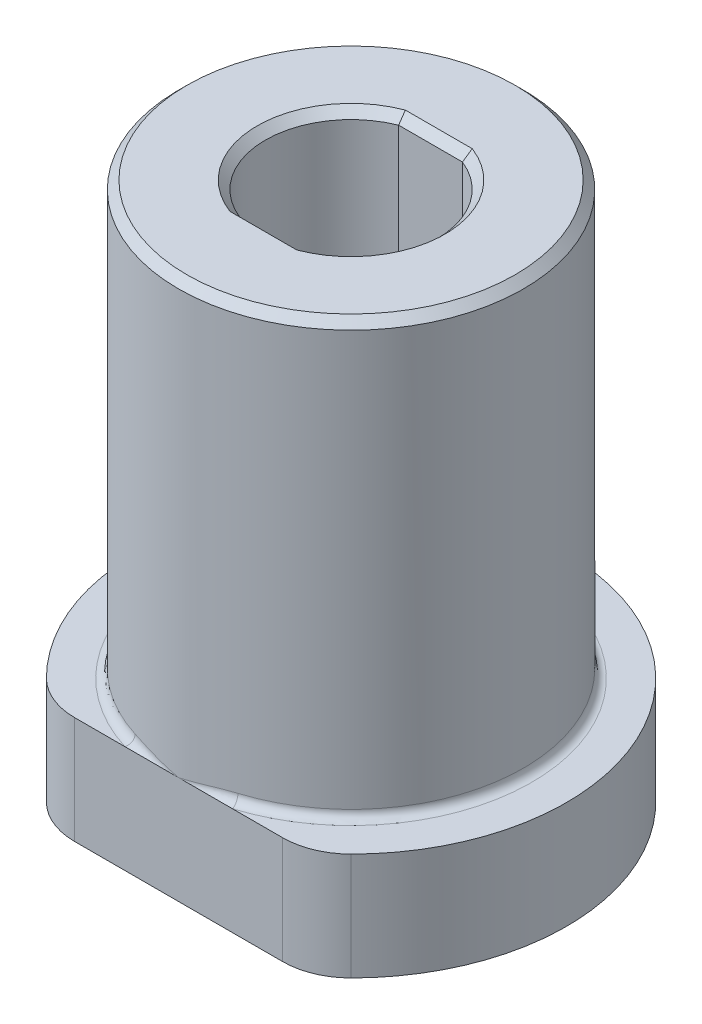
ISO-10303-21;
HEADER;
FILE_DESCRIPTION(('STEP AP214'),'2;1');
FILE_NAME('part.step','',(''),(''),'','','');
FILE_SCHEMA(('AUTOMOTIVE_DESIGN { 1 0 10303 214 1 1 1 1 }'));
ENDSEC;
DATA;
#1=APPLICATION_CONTEXT('core data for automotive mechanical design processes');
#2=APPLICATION_PROTOCOL_DEFINITION('international standard','automotive_design',2000,#1);
#3=PRODUCT_CONTEXT('',#1,'mechanical');
#4=PRODUCT('Part','Part','',(#3));
#5=PRODUCT_RELATED_PRODUCT_CATEGORY('part','',(#4));
#6=PRODUCT_DEFINITION_FORMATION('','',#4);
#7=PRODUCT_DEFINITION_CONTEXT('part definition',#1,'design');
#8=PRODUCT_DEFINITION('design','',#6,#7);
#9=PRODUCT_DEFINITION_SHAPE('','',#8);
#10=(LENGTH_UNIT() NAMED_UNIT(*) SI_UNIT(.MILLI.,.METRE.));
#11=(NAMED_UNIT(*) PLANE_ANGLE_UNIT() SI_UNIT($,.RADIAN.));
#12=(NAMED_UNIT(*) SI_UNIT($,.STERADIAN.) SOLID_ANGLE_UNIT());
#13=UNCERTAINTY_MEASURE_WITH_UNIT(LENGTH_MEASURE(1.E-05),#10,'distance_accuracy_value','');
#14=(GEOMETRIC_REPRESENTATION_CONTEXT(3) GLOBAL_UNCERTAINTY_ASSIGNED_CONTEXT((#13)) GLOBAL_UNIT_ASSIGNED_CONTEXT((#10,
#11,#12)) REPRESENTATION_CONTEXT('',''));
#15=CARTESIAN_POINT('',(0.,0.,0.));
#16=DIRECTION('',(0.,0.,1.));
#17=DIRECTION('',(1.,0.,0.));
#18=AXIS2_PLACEMENT_3D('',#15,#16,#17);
#19=CARTESIAN_POINT('',(0.,24.9936,0.));
#20=DIRECTION('',(0.,-1.,0.));
#21=DIRECTION('',(0.,0.,-1.));
#22=AXIS2_PLACEMENT_3D('',#19,#20,#21);
#23=CYLINDRICAL_SURFACE('',#22,7.99592);
#24=CARTESIAN_POINT('',(0.,24.6126,0.));
#25=DIRECTION('',(0.,1.,0.));
#26=DIRECTION('',(0.,0.,1.));
#27=AXIS2_PLACEMENT_3D('',#24,#25,#26);
#28=CIRCLE('',#27,7.99592);
#29=CARTESIAN_POINT('',(0.,24.6126,7.99592));
#30=VERTEX_POINT('',#29);
#31=EDGE_CURVE('E12',#30,#30,#28,.F.);
#32=ORIENTED_EDGE('',*,*,#31,.T.);
#33=EDGE_LOOP('',(#32));
#34=FACE_BOUND('',#33,.T.);
#35=CARTESIAN_POINT('',(-3.03442522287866,5.26963246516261,7.3977699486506));
#36=CARTESIAN_POINT('',(-2.9681699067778,5.04591455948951,7.42494662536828));
#37=CARTESIAN_POINT('',(-3.01805704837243,4.9454309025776,7.63132576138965));
#38=CARTESIAN_POINT('',(-3.06794418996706,4.84494724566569,7.83770489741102));
#39=CARTESIAN_POINT('',(-3.17901346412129,4.9784,7.99592));
#40=CARTESIAN_POINT('',(-3.01029299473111,5.27835756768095,7.40766961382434));
#41=CARTESIAN_POINT('',(-2.9499497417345,5.05675977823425,7.43217232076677));
#42=CARTESIAN_POINT('',(-2.99888466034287,4.95425714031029,7.63324280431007));
#43=CARTESIAN_POINT('',(-3.04800528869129,4.85167526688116,7.8342887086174));
#44=CARTESIAN_POINT('',(-3.1537313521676,4.9784,7.99592));
#45=CARTESIAN_POINT('',(-2.98587072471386,5.28616459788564,7.41754818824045));
#46=CARTESIAN_POINT('',(-2.93061589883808,5.06697060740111,7.4397746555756));
#47=CARTESIAN_POINT('',(-2.97872883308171,4.96272199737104,7.63573066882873));
#48=CARTESIAN_POINT('',(-3.0270199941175,4.85840598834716,7.83166032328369));
#49=CARTESIAN_POINT('',(-3.12814537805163,4.9784,7.99592));
#50=CARTESIAN_POINT('',(-2.93659881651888,5.30020744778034,7.43719183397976));
#51=CARTESIAN_POINT('',(-2.89039429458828,5.08606391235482,7.4554180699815));
#52=CARTESIAN_POINT('',(-2.93692498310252,4.97887261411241,7.64156416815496));
#53=CARTESIAN_POINT('',(-2.98362846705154,4.87161311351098,7.82768762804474));
#54=CARTESIAN_POINT('',(-3.07652569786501,4.9784,7.99592));
#55=CARTESIAN_POINT('',(-2.91174960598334,5.30644475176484,7.44695700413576));
#56=CARTESIAN_POINT('',(-2.8695058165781,5.09496586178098,7.46346096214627));
#57=CARTESIAN_POINT('',(-2.91527839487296,4.98655910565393,7.64490898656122));
#58=CARTESIAN_POINT('',(-2.96121909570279,4.87809683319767,7.82632993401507));
#59=CARTESIAN_POINT('',(-3.05049243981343,4.9784,7.99592));
#60=CARTESIAN_POINT('',(-2.86181343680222,5.31761001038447,7.46628933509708));
#61=CARTESIAN_POINT('',(-2.82669405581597,5.11150166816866,7.47973713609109));
#62=CARTESIAN_POINT('',(-2.87100335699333,5.0010893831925,7.65216513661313));
#63=CARTESIAN_POINT('',(-2.91547976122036,4.8906225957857,7.82456527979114));
#64=CARTESIAN_POINT('',(-2.99817684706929,4.9784,7.99592));
#65=CARTESIAN_POINT('',(-2.83672754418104,5.32254225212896,7.47585704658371));
#66=CARTESIAN_POINT('',(-2.80476947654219,5.11915401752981,7.48797310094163));
#67=CARTESIAN_POINT('',(-2.84837841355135,5.00793588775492,7.65607454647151));
#68=CARTESIAN_POINT('',(-2.89214641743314,4.8966730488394,7.82414754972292));
#69=CARTESIAN_POINT('',(-2.97189562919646,4.9784,7.99592));
#70=CARTESIAN_POINT('',(-2.7863021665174,5.33130554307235,7.4947970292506));
#71=CARTESIAN_POINT('',(-2.76007575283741,5.13334447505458,7.50453603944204));
#72=CARTESIAN_POINT('',(-2.80232233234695,5.02085226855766,7.66430221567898));
#73=CARTESIAN_POINT('',(-2.84472668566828,4.9083159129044,7.82404023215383));
#74=CARTESIAN_POINT('',(-2.9190675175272,4.9784,7.99592));
#75=CARTESIAN_POINT('',(-2.76096261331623,5.33513628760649,7.50416924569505));
#76=CARTESIAN_POINT('',(-2.73729969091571,5.13989384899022,7.51286703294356));
#77=CARTESIAN_POINT('',(-2.77889097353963,5.02692192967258,7.6686205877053));
#78=CARTESIAN_POINT('',(-2.82063201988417,4.91391457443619,7.82434583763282));
#79=CARTESIAN_POINT('',(-2.89252055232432,4.9784,7.99592));
#80=CARTESIAN_POINT('',(-2.68511018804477,5.34514088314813,7.53178572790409));
#81=CARTESIAN_POINT('',(-2.66863521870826,5.15786392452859,7.53762207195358));
#82=CARTESIAN_POINT('',(-2.70810743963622,5.04392697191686,7.6819080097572));
#83=CARTESIAN_POINT('',(-2.74816348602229,4.92984869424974,7.82608472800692));
#84=CARTESIAN_POINT('',(-2.8130538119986,4.9784,7.99592));
#85=CARTESIAN_POINT('',(-2.63431009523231,5.34992212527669,7.54970548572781));
#86=CARTESIAN_POINT('',(-2.62155004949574,5.16791630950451,7.55413558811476));
#87=CARTESIAN_POINT('',(-2.65985814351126,5.0537881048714,7.69128011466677));
#88=CARTESIAN_POINT('',(-2.69868878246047,4.93956695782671,7.82832293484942));
#89=CARTESIAN_POINT('',(-2.75983313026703,4.9784,7.99592));
#90=CARTESIAN_POINT('',(-2.5321622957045,5.35656697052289,7.58457710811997));
#91=CARTESIAN_POINT('',(-2.52575096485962,5.18476074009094,7.58669242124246));
#92=CARTESIAN_POINT('',(-2.56178706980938,5.07102987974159,7.71046720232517));
#93=CARTESIAN_POINT('',(-2.59834127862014,4.95720899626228,7.83414009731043));
#94=CARTESIAN_POINT('',(-2.65281805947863,4.9784,7.99592));
#95=CARTESIAN_POINT('',(-2.48081403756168,5.35842728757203,7.60152786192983));
#96=CARTESIAN_POINT('',(-2.476981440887,5.1915959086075,7.60276426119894));
#97=CARTESIAN_POINT('',(-2.51196358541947,5.07840772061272,7.72028267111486));
#98=CARTESIAN_POINT('',(-2.54740733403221,4.96516270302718,7.83771075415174));
#99=CARTESIAN_POINT('',(-2.59902309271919,4.9784,7.99592));
#100=CARTESIAN_POINT('',(-2.35695109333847,5.36005826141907,7.64102606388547));
#101=CARTESIAN_POINT('',(-2.35865831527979,5.20475953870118,7.64046190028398));
#102=CARTESIAN_POINT('',(-2.39093121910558,5.0935846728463,7.74393634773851));
#103=CARTESIAN_POINT('',(-2.42410664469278,4.98229517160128,7.84723457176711));
#104=CARTESIAN_POINT('',(-2.46925816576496,4.9784,7.99592));
#105=CARTESIAN_POINT('',(-2.28426201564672,5.3586817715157,7.66306954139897));
#106=CARTESIAN_POINT('',(-2.28824392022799,5.20987514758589,7.66186624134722));
#107=CARTESIAN_POINT('',(-2.31921090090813,5.10035088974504,7.75779847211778));
#108=CARTESIAN_POINT('',(-2.35094762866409,4.99077024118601,7.85358642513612));
#109=CARTESIAN_POINT('',(-2.39310550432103,4.9784,7.99592));
#110=CARTESIAN_POINT('',(-2.13841236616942,5.35234649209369,7.70504348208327));
#111=CARTESIAN_POINT('',(-2.14608877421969,5.2159486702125,7.70289111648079));
#112=CARTESIAN_POINT('',(-2.17444655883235,5.11049731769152,7.7849810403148));
#113=CARTESIAN_POINT('',(-2.20356234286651,5.00499525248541,7.86692837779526));
#114=CARTESIAN_POINT('',(-2.24030622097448,4.9784,7.99592));
#115=CARTESIAN_POINT('',(-2.06525163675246,5.34738643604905,7.72497319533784));
#116=CARTESIAN_POINT('',(-2.07423236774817,5.21695409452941,7.72256691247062));
#117=CARTESIAN_POINT('',(-2.10140207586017,5.11387633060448,7.79830129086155));
#118=CARTESIAN_POINT('',(-2.1292130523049,5.01078563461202,7.87392414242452));
#119=CARTESIAN_POINT('',(-2.16365943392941,4.9784,7.99592));
#120=CARTESIAN_POINT('',(-1.84517723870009,5.32828509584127,7.78158115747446));
#121=CARTESIAN_POINT('',(-1.85820950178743,5.21505965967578,7.77841891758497));
#122=CARTESIAN_POINT('',(-1.88083511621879,5.11991143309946,7.83688185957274));
#123=CARTESIAN_POINT('',(-1.90602930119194,5.02468381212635,7.89489425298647));
#124=CARTESIAN_POINT('',(-1.93309864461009,4.9784,7.99592));
#125=CARTESIAN_POINT('',(-1.69776296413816,5.30992357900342,7.81504906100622));
#126=CARTESIAN_POINT('',(-1.71119566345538,5.20738228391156,7.81214210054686));
#127=CARTESIAN_POINT('',(-1.73196952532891,5.11845614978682,7.86074344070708));
#128=CARTESIAN_POINT('',(-1.75457542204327,5.02958269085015,7.90908570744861));
#129=CARTESIAN_POINT('',(-1.77866018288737,4.9784,7.99592));
#130=CARTESIAN_POINT('',(-1.4011758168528,5.26585322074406,7.87365791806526));
#131=CARTESIAN_POINT('',(-1.41479580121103,5.18351652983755,7.87121807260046));
#132=CARTESIAN_POINT('',(-1.43135854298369,5.10825372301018,7.9033127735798));
#133=CARTESIAN_POINT('',(-1.449735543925,5.03306194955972,7.93515020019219));
#134=CARTESIAN_POINT('',(-1.46794086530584,4.9784,7.99592));
#135=CARTESIAN_POINT('',(-1.25199811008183,5.24008935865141,7.89873335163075));
#136=CARTESIAN_POINT('',(-1.26475245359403,5.16731273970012,7.89674174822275));
#137=CARTESIAN_POINT('',(-1.27959984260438,5.09945099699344,7.92197978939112));
#138=CARTESIAN_POINT('',(-1.29567121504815,5.03167866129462,7.94709243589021));
#139=CARTESIAN_POINT('',(-1.3116549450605,4.9784,7.99592));
#140=CARTESIAN_POINT('',(-0.953224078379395,5.18394429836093,7.94033043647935));
#141=CARTESIAN_POINT('',(-0.964070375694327,5.12957671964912,7.93903448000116));
#142=CARTESIAN_POINT('',(-0.97504638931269,5.07711652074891,7.95325910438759));
#143=CARTESIAN_POINT('',(-0.987233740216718,5.02474550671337,7.96735900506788));
#144=CARTESIAN_POINT('',(-0.99864453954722,4.9784,7.99592));
#145=CARTESIAN_POINT('',(-0.803627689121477,5.15356234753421,7.95685069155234));
#146=CARTESIAN_POINT('',(-0.812893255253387,5.10801779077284,7.9559480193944));
#147=CARTESIAN_POINT('',(-0.82225147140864,5.06358399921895,7.96587041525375));
#148=CARTESIAN_POINT('',(-0.832305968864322,5.01921553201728,7.97574808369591));
#149=CARTESIAN_POINT('',(-0.841919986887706,4.9784,7.99592));
#150=CARTESIAN_POINT('',(-0.547755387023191,5.09946123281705,7.97784772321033));
#151=CARTESIAN_POINT('',(-0.554256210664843,5.06867942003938,7.97741486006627));
#152=CARTESIAN_POINT('',(-0.560649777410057,5.03820738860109,7.98196929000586));
#153=CARTESIAN_POINT('',(-0.567387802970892,5.00777033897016,7.9865038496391));
#154=CARTESIAN_POINT('',(-0.573855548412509,4.9784,7.99592));
#155=CARTESIAN_POINT('',(-0.441521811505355,5.07637108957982,7.98442911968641));
#156=CARTESIAN_POINT('',(-0.446768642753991,5.05161433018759,7.98415671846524));
#157=CARTESIAN_POINT('',(-0.451961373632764,5.02701517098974,7.98704313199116));
#158=CARTESIAN_POINT('',(-0.45732941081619,5.0024347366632,7.98992438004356));
#159=CARTESIAN_POINT('',(-0.462560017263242,4.9784,7.99592));
#160=CARTESIAN_POINT('',(-0.229218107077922,5.02959670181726,7.99333839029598));
#161=CARTESIAN_POINT('',(-0.232032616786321,5.01680450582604,7.99327229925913));
#162=CARTESIAN_POINT('',(-0.234677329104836,5.00398899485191,7.99392028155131));
#163=CARTESIAN_POINT('',(-0.237496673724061,4.99119184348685,7.9945623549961));
#164=CARTESIAN_POINT('',(-0.240140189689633,4.9784,7.99592));
#165=CARTESIAN_POINT('',(-0.123148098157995,5.00591379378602,7.99567508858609));
#166=CARTESIAN_POINT('',(-0.124619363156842,4.99903570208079,7.99566906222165));
#167=CARTESIAN_POINT('',(-0.126081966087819,4.99215642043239,7.99573037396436));
#168=CARTESIAN_POINT('',(-0.127553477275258,4.98527807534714,7.99579145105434));
#169=CARTESIAN_POINT('',(-0.129016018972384,4.9784,7.99592));
#170=CARTESIAN_POINT('',(-0.0113921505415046,4.98094531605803,7.99591391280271));
#171=CARTESIAN_POINT('',(-0.0115278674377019,4.98030898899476,7.99591377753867));
#172=CARTESIAN_POINT('',(-0.0116635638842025,4.97967265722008,7.99591529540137));
#173=CARTESIAN_POINT('',(-0.0117992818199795,4.97903632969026,7.99591682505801));
#174=CARTESIAN_POINT('',(-0.0119349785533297,4.9784,7.99592));
#175=CARTESIAN_POINT('',(-0.00569605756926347,4.97967265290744,7.99591999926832));
#176=CARTESIAN_POINT('',(-0.00576390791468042,4.97935448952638,7.99592001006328));
#177=CARTESIAN_POINT('',(-0.00583176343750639,4.97903632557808,7.99592000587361));
#178=CARTESIAN_POINT('',(-0.00589961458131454,4.97871816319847,7.99592001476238));
#179=CARTESIAN_POINT('',(-0.00596747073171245,4.9784,7.99592));
#180=CARTESIAN_POINT('',(0.,4.9784,7.99592));
#181=CARTESIAN_POINT('',(0.,4.9784,7.99592));
#182=CARTESIAN_POINT('',(0.,4.9784,7.99592));
#183=CARTESIAN_POINT('',(0.,4.9784,7.99592));
#184=CARTESIAN_POINT('',(0.,4.9784,7.99592));
#185=(BOUNDED_SURFACE() B_SPLINE_SURFACE(3,2,((#35,#36,#37,#38,#39),(#40,#41,#42,#43,#44),(#45,
#46,#47,#48,#49),(#50,#51,#52,#53,#54),(#55,#56,#57,#58,#59),(#60,#61,#62,#63,#64),(#65,#66,#67,
#68,#69),(#70,#71,#72,#73,#74),(#75,#76,#77,#78,#79),(#80,#81,#82,#83,#84),(#85,#86,#87,#88,
#89),(#90,#91,#92,#93,#94),(#95,#96,#97,#98,#99),(#100,#101,#102,#103,#104),(#105,#106,#107,
#108,#109),(#110,#111,#112,#113,#114),(#115,#116,#117,#118,#119),(#120,#121,#122,#123,#124),
(#125,#126,#127,#128,#129),(#130,#131,#132,#133,#134),(#135,#136,#137,#138,#139),(#140,#141,
#142,#143,#144),(#145,#146,#147,#148,#149),(#150,#151,#152,#153,#154),(#155,#156,#157,#158,
#159),(#160,#161,#162,#163,#164),(#165,#166,#167,#168,#169),(#170,#171,#172,#173,#174),(#175,
#176,#177,#178,#179),(#180,#181,#182,#183,#184)),.UNSPECIFIED.,.F.,.F.,
.F.) B_SPLINE_SURFACE_WITH_KNOTS((4,2,2,2,2,2,2,2,2,2,2,2,2,2,4),(3,2,3),(0.,0.0860131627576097,
0.171944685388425,0.257590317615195,0.343259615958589,0.51304724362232,0.683025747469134,
0.921641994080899,1.16034261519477,1.63804478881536,2.1193938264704,2.60082139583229,
2.94236710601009,3.28320197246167,3.30150708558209),(0.,0.5,1.),
.UNSPECIFIED.) GEOMETRIC_REPRESENTATION_ITEM() RATIONAL_B_SPLINE_SURFACE(((1.,0.851220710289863,
1.,0.851220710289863,1.),(1.,0.855203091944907,1.,0.855203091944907,1.),(1.,0.858993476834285,
1.,0.858993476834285,1.),(1.,0.866236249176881,1.,0.866236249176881,1.),(1.,0.869688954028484,
1.,0.869688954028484,1.),(1.,0.876298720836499,1.,0.876298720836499,1.),(1.,0.879456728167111,
1.,0.879456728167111,1.),(1.,0.885527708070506,1.,0.885527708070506,1.),(1.,0.888440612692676,
1.,0.888440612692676,1.),(1.,0.896807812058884,1.,0.896807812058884,1.),(1.,0.901949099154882,
1.,0.901949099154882,1.),(1.,0.911570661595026,1.,0.911570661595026,1.),(1.,0.916050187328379,
1.,0.916050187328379,1.),(1.,0.92616226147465,1.,0.92616226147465,1.),(1.,0.931529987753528,1.,
0.931529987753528,1.),(1.,0.941412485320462,1.,0.941412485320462,1.),(1.,0.945926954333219,1.,
0.945926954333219,1.),(1.,0.958423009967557,1.,0.958423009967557,1.),(1.,0.965350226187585,1.,
0.965350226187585,1.),(1.,0.977130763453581,1.,0.977130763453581,1.),(1.,0.981967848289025,1.,
0.981967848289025,1.),(1.,0.989851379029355,1.,0.989851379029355,1.),(1.,0.992897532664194,1.,
0.992897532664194,1.),(1.,0.996737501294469,1.,0.996737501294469,1.),(1.,0.997928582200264,1.,
0.997928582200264,1.),(1.,0.999537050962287,1.,0.999537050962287,1.),(1.,0.999956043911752,1.,
0.999956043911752,1.),(1.,0.999998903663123,1.,0.999998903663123,1.),(1.,0.999999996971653,1.,
0.999999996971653,1.),(1.,1.,1.,1.,1.))) REPRESENTATION_ITEM('') SURFACE());
#186=CARTESIAN_POINT('',(-3.03442522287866,5.26963246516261,7.3977699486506));
#187=CARTESIAN_POINT('',(-3.01029299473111,5.27835756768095,7.40766961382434));
#188=CARTESIAN_POINT('',(-2.98587072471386,5.28616459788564,7.41754818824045));
#189=CARTESIAN_POINT('',(-2.93659881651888,5.30020744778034,7.43719183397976));
#190=CARTESIAN_POINT('',(-2.91174960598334,5.30644475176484,7.44695700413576));
#191=CARTESIAN_POINT('',(-2.86181343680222,5.31761001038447,7.46628933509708));
#192=CARTESIAN_POINT('',(-2.83672754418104,5.32254225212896,7.47585704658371));
#193=CARTESIAN_POINT('',(-2.7863021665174,5.33130554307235,7.4947970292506));
#194=CARTESIAN_POINT('',(-2.76096261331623,5.33513628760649,7.50416924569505));
#195=CARTESIAN_POINT('',(-2.68511018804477,5.34514088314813,7.53178572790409));
#196=CARTESIAN_POINT('',(-2.63431009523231,5.34992212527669,7.54970548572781));
#197=CARTESIAN_POINT('',(-2.5321622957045,5.35656697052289,7.58457710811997));
#198=CARTESIAN_POINT('',(-2.48081403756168,5.35842728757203,7.60152786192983));
#199=CARTESIAN_POINT('',(-2.35695109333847,5.36005826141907,7.64102606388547));
#200=CARTESIAN_POINT('',(-2.28426201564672,5.3586817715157,7.66306954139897));
#201=CARTESIAN_POINT('',(-2.13841236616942,5.35234649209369,7.70504348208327));
#202=CARTESIAN_POINT('',(-2.06525163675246,5.34738643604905,7.72497319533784));
#203=CARTESIAN_POINT('',(-1.84517723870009,5.32828509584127,7.78158115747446));
#204=CARTESIAN_POINT('',(-1.69776296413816,5.30992357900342,7.81504906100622));
#205=CARTESIAN_POINT('',(-1.4011758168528,5.26585322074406,7.87365791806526));
#206=CARTESIAN_POINT('',(-1.25199811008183,5.24008935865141,7.89873335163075));
#207=CARTESIAN_POINT('',(-0.953224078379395,5.18394429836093,7.94033043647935));
#208=CARTESIAN_POINT('',(-0.803627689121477,5.15356234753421,7.95685069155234));
#209=CARTESIAN_POINT('',(-0.547755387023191,5.09946123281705,7.97784772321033));
#210=CARTESIAN_POINT('',(-0.441521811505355,5.07637108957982,7.98442911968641));
#211=CARTESIAN_POINT('',(-0.229218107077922,5.02959670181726,7.99333839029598));
#212=CARTESIAN_POINT('',(-0.123148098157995,5.00591379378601,7.99567508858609));
#213=CARTESIAN_POINT('',(-0.0113921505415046,4.98094531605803,7.99591391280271));
#214=CARTESIAN_POINT('',(-0.00569605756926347,4.97967265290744,7.99591999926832));
#215=CARTESIAN_POINT('',(0.,4.9784,7.99592));
#216=B_SPLINE_CURVE_WITH_KNOTS('',3,(#186,#187,#188,#189,#190,#191,#192,#193,#194,#195,#196,
#197,#198,#199,#200,#201,#202,#203,#204,#205,#206,#207,#208,#209,#210,#211,#212,#213,#214,#215),
.UNSPECIFIED.,.F.,.F.,(4,2,2,2,2,2,2,2,2,2,2,2,2,2,4),(0.,0.0860131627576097,0.171944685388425,
0.257590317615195,0.343259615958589,0.51304724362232,0.683025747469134,0.921641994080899,
1.16034261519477,1.63804478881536,2.1193938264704,2.60082139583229,2.94236710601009,
3.28320197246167,3.30150708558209),.UNSPECIFIED.);
#217=CARTESIAN_POINT('',(-2.38401272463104,5.3594,7.63224868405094));
#218=VERTEX_POINT('',#217);
#219=CARTESIAN_POINT('',(0.,4.9784,7.99592));
#220=VERTEX_POINT('',#219);
#221=EDGE_CURVE('E144',#218,#220,#216,.T.);
#222=ORIENTED_EDGE('',*,*,#221,.T.);
#223=CARTESIAN_POINT('',(3.17901346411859,4.9784,7.99592));
#224=CARTESIAN_POINT('',(3.06794418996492,4.84494724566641,7.83770489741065));
#225=CARTESIAN_POINT('',(3.01805704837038,4.94543090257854,7.63132576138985));
#226=CARTESIAN_POINT('',(2.96816990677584,5.04591455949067,7.42494662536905));
#227=CARTESIAN_POINT('',(3.03442522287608,5.26963246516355,7.39776994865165));
#228=CARTESIAN_POINT('',(3.15373135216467,4.9784,7.99592));
#229=CARTESIAN_POINT('',(3.04800528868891,4.85167526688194,7.83428870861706));
#230=CARTESIAN_POINT('',(2.99888466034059,4.95425714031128,7.63324280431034));
#231=CARTESIAN_POINT('',(2.94994974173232,5.05675977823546,7.43217232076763));
#232=CARTESIAN_POINT('',(3.01029299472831,5.27835756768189,7.40766961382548));
#233=CARTESIAN_POINT('',(3.12814537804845,4.9784,7.99592));
#234=CARTESIAN_POINT('',(3.02701999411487,4.85840598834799,7.83166032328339));
#235=CARTESIAN_POINT('',(2.97872883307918,4.96272199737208,7.63573066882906));
#236=CARTESIAN_POINT('',(2.93061589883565,5.06697060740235,7.43977465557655));
#237=CARTESIAN_POINT('',(2.98587072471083,5.28616459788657,7.41754818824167));
#238=CARTESIAN_POINT('',(3.07652569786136,4.9784,7.99592));
#239=CARTESIAN_POINT('',(2.98362846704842,4.8716131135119,7.82768762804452));
#240=CARTESIAN_POINT('',(2.93692498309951,4.97887261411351,7.64156416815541));
#241=CARTESIAN_POINT('',(2.89039429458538,5.08606391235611,7.45541806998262));
#242=CARTESIAN_POINT('',(2.93659881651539,5.30020744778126,7.43719183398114));
#243=CARTESIAN_POINT('',(3.05049243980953,4.9784,7.99592));
#244=CARTESIAN_POINT('',(2.96121909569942,4.87809683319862,7.82632993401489));
#245=CARTESIAN_POINT('',(2.9152783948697,4.98655910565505,7.64490898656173));
#246=CARTESIAN_POINT('',(2.86950581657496,5.09496586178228,7.46346096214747));
#247=CARTESIAN_POINT('',(2.91174960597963,5.30644475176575,7.44695700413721));
#248=CARTESIAN_POINT('',(2.99817684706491,4.9784,7.99592));
#249=CARTESIAN_POINT('',(2.9154797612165,4.89062259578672,7.82456527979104));
#250=CARTESIAN_POINT('',(2.87100335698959,5.00108938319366,7.65216513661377));
#251=CARTESIAN_POINT('',(2.82669405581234,5.11150166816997,7.47973713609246));
#252=CARTESIAN_POINT('',(2.86181343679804,5.31761001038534,7.46628933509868));
#253=CARTESIAN_POINT('',(2.97189562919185,4.9784,7.99592));
#254=CARTESIAN_POINT('',(2.89214641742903,4.89667304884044,7.82414754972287));
#255=CARTESIAN_POINT('',(2.84837841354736,5.0079358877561,7.65607454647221));
#256=CARTESIAN_POINT('',(2.80476947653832,5.11915401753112,7.48797310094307));
#257=CARTESIAN_POINT('',(2.83672754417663,5.3225422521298,7.47585704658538));
#258=CARTESIAN_POINT('',(2.91906751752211,4.9784,7.99592));
#259=CARTESIAN_POINT('',(2.84472668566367,4.90831591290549,7.82404023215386));
#260=CARTESIAN_POINT('',(2.80232233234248,5.02085226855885,7.66430221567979));
#261=CARTESIAN_POINT('',(2.76007575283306,5.13334447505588,7.50453603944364));
#262=CARTESIAN_POINT('',(2.78630216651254,5.33130554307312,7.4947970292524));
#263=CARTESIAN_POINT('',(2.89252055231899,4.9784,7.99592));
#264=CARTESIAN_POINT('',(2.82063201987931,4.9139145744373,7.8243458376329));
#265=CARTESIAN_POINT('',(2.77889097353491,5.02692192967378,7.66862058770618));
#266=CARTESIAN_POINT('',(2.73729969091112,5.1398938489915,7.51286703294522));
#267=CARTESIAN_POINT('',(2.76096261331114,5.33513628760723,7.50416924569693));
#268=CARTESIAN_POINT('',(2.81305381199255,4.9784,7.99592));
#269=CARTESIAN_POINT('',(2.7481634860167,4.92984869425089,7.82608472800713));
#270=CARTESIAN_POINT('',(2.70810743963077,5.04392697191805,7.68190800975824));
#271=CARTESIAN_POINT('',(2.66863521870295,5.15786392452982,7.53762207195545));
#272=CARTESIAN_POINT('',(2.68511018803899,5.34514088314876,7.53178572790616));
#273=CARTESIAN_POINT('',(2.7598331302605,4.9784,7.99592));
#274=CARTESIAN_POINT('',(2.69868878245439,4.93956695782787,7.82832293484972));
#275=CARTESIAN_POINT('',(2.65985814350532,5.05378810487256,7.69128011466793));
#276=CARTESIAN_POINT('',(2.62155004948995,5.16791630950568,7.55413558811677));
#277=CARTESIAN_POINT('',(2.63431009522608,5.34992212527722,7.54970548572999));
#278=CARTESIAN_POINT('',(2.65281805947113,4.9784,7.99592));
#279=CARTESIAN_POINT('',(2.59834127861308,4.95720899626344,7.83414009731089));
#280=CARTESIAN_POINT('',(2.56178706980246,5.07102987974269,7.71046720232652));
#281=CARTESIAN_POINT('',(2.52575096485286,5.18476074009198,7.58669242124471));
#282=CARTESIAN_POINT('',(2.53216229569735,5.35656697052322,7.58457710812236));
#283=CARTESIAN_POINT('',(2.59902309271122,4.9784,7.99592));
#284=CARTESIAN_POINT('',(2.54740733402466,4.96516270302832,7.83771075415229));
#285=CARTESIAN_POINT('',(2.51196358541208,5.07840772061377,7.72028267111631));
#286=CARTESIAN_POINT('',(2.47698144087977,5.19159590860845,7.6027642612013));
#287=CARTESIAN_POINT('',(2.48081403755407,5.35842728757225,7.60152786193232));
#288=CARTESIAN_POINT('',(2.46925816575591,4.9784,7.99592));
#289=CARTESIAN_POINT('',(2.42410664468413,4.98229517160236,7.84723457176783));
#290=CARTESIAN_POINT('',(2.39093121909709,5.0935846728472,7.74393634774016));
#291=CARTESIAN_POINT('',(2.35865831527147,5.2047595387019,7.64046190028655));
#292=CARTESIAN_POINT('',(2.35695109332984,5.36005826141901,7.64102606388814));
#293=CARTESIAN_POINT('',(2.39310550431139,4.9784,7.99592));
#294=CARTESIAN_POINT('',(2.35094762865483,4.99077024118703,7.85358642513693));
#295=CARTESIAN_POINT('',(2.31921090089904,5.10035088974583,7.75779847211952));
#296=CARTESIAN_POINT('',(2.28824392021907,5.20987514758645,7.66186624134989));
#297=CARTESIAN_POINT('',(2.28426201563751,5.35868177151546,7.66306954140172));
#298=CARTESIAN_POINT('',(2.24030622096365,4.9784,7.99592));
#299=CARTESIAN_POINT('',(2.20356234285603,5.00499525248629,7.86692837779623));
#300=CARTESIAN_POINT('',(2.17444655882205,5.11049731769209,7.7849810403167));
#301=CARTESIAN_POINT('',(2.14608877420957,5.21594867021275,7.70289111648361));
#302=CARTESIAN_POINT('',(2.13841236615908,5.35234649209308,7.70504348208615));
#303=CARTESIAN_POINT('',(2.16365943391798,4.9784,7.99592));
#304=CARTESIAN_POINT('',(2.12921305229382,5.01078563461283,7.87392414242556));
#305=CARTESIAN_POINT('',(2.10140207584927,5.11387633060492,7.79830129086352));
#306=CARTESIAN_POINT('',(2.07423236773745,5.21695409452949,7.7225669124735));
#307=CARTESIAN_POINT('',(2.06525163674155,5.34738643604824,7.72497319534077));
#308=CARTESIAN_POINT('',(1.93309864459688,4.9784,7.99592));
#309=CARTESIAN_POINT('',(1.90602930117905,5.02468381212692,7.89489425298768));
#310=CARTESIAN_POINT('',(1.8808351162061,5.11991143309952,7.83688185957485));
#311=CARTESIAN_POINT('',(1.85820950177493,5.21505965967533,7.77841891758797));
#312=CARTESIAN_POINT('',(1.84517723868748,5.32828509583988,7.78158115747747));
#313=CARTESIAN_POINT('',(1.77866018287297,4.9784,7.99592));
#314=CARTESIAN_POINT('',(1.75457542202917,5.02958269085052,7.90908570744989));
#315=CARTESIAN_POINT('',(1.73196952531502,5.11845614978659,7.86074344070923));
#316=CARTESIAN_POINT('',(1.71119566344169,5.20738228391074,7.81214210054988));
#317=CARTESIAN_POINT('',(1.69776296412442,5.30992357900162,7.81504906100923));
#318=CARTESIAN_POINT('',(1.46794086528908,4.9784,7.99592));
#319=CARTESIAN_POINT('',(1.44973554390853,5.0330619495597,7.93515020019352));
#320=CARTESIAN_POINT('',(1.43135854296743,5.10825372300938,7.90331277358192));
#321=CARTESIAN_POINT('',(1.41479580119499,5.18351652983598,7.87121807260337));
#322=CARTESIAN_POINT('',(1.4011758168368,5.26585322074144,7.87365791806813));
#323=CARTESIAN_POINT('',(1.31165494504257,4.9784,7.99592));
#324=CARTESIAN_POINT('',(1.29567121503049,5.0316786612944,7.94709243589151));
#325=CARTESIAN_POINT('',(1.27959984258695,5.09945099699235,7.92197978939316));
#326=CARTESIAN_POINT('',(1.26475245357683,5.16731273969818,7.89674174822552));
#327=CARTESIAN_POINT('',(1.25199811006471,5.24008935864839,7.89873335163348));
#328=CARTESIAN_POINT('',(0.998644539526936,4.9784,7.99592));
#329=CARTESIAN_POINT('',(0.987233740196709,5.02474550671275,7.96735900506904));
#330=CARTESIAN_POINT('',(0.97504638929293,5.07711652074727,7.95325910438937));
#331=CARTESIAN_POINT('',(0.964070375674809,5.12957671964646,7.93903448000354));
#332=CARTESIAN_POINT('',(0.953224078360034,5.18394429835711,7.94033043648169));
#333=CARTESIAN_POINT('',(0.841919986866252,4.9784,7.99592));
#334=CARTESIAN_POINT('',(0.832305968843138,5.01921553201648,7.97574808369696));
#335=CARTESIAN_POINT('',(0.822251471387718,5.06358399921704,7.96587041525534));
#336=CARTESIAN_POINT('',(0.812893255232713,5.10801779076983,7.95594801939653));
#337=CARTESIAN_POINT('',(0.803627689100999,5.15356234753,7.95685069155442));
#338=CARTESIAN_POINT('',(0.573855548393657,4.9784,7.99592));
#339=CARTESIAN_POINT('',(0.567387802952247,5.00777033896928,7.98650384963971));
#340=CARTESIAN_POINT('',(0.560649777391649,5.03820738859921,7.98196929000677));
#341=CARTESIAN_POINT('',(0.554256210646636,5.06867942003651,7.97741486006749));
#342=CARTESIAN_POINT('',(0.547755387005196,5.09946123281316,7.97784772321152));
#343=CARTESIAN_POINT('',(0.462560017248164,4.9784,7.99592));
#344=CARTESIAN_POINT('',(0.457329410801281,5.00243473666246,7.98992438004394));
#345=CARTESIAN_POINT('',(0.451961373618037,5.02701517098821,7.98704313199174));
#346=CARTESIAN_POINT('',(0.446768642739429,5.05161433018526,7.98415671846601));
#347=CARTESIAN_POINT('',(0.441521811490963,5.07637108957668,7.98442911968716));
#348=CARTESIAN_POINT('',(0.240140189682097,4.9784,7.99592));
#349=CARTESIAN_POINT('',(0.237496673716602,4.99119184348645,7.99456235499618));
#350=CARTESIAN_POINT('',(0.234677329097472,5.00398899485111,7.99392028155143));
#351=CARTESIAN_POINT('',(0.232032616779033,5.01680450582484,7.99327229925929));
#352=CARTESIAN_POINT('',(0.229218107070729,5.02959670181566,7.99333839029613));
#353=CARTESIAN_POINT('',(0.129016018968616,4.9784,7.99592));
#354=CARTESIAN_POINT('',(0.127553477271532,4.98527807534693,7.99579145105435));
#355=CARTESIAN_POINT('',(0.126081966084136,4.99215642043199,7.99573037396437));
#356=CARTESIAN_POINT('',(0.124619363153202,4.99903570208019,7.99566906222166));
#357=CARTESIAN_POINT('',(0.123148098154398,5.00591379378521,7.9956750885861));
#358=CARTESIAN_POINT('',(0.0119349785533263,4.9784,7.99592));
#359=CARTESIAN_POINT('',(0.0117992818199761,4.97903632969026,7.99591682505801));
#360=CARTESIAN_POINT('',(0.0116635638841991,4.97967265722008,7.99591529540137));
#361=CARTESIAN_POINT('',(0.0115278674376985,4.98030898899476,7.99591377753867));
#362=CARTESIAN_POINT('',(0.0113921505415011,4.98094531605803,7.99591391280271));
#363=CARTESIAN_POINT('',(0.00596747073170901,4.9784,7.99592));
#364=CARTESIAN_POINT('',(0.00589961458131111,4.97871816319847,7.99592001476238));
#365=CARTESIAN_POINT('',(0.00583176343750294,4.97903632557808,7.99592000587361));
#366=CARTESIAN_POINT('',(0.00576390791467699,4.97935448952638,7.99592001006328));
#367=CARTESIAN_POINT('',(0.00569605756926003,4.97967265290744,7.99591999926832));
#368=CARTESIAN_POINT('',(0.,4.9784,7.99592));
#369=CARTESIAN_POINT('',(0.,4.9784,7.99592));
#370=CARTESIAN_POINT('',(0.,4.9784,7.99592));
#371=CARTESIAN_POINT('',(0.,4.9784,7.99592));
#372=CARTESIAN_POINT('',(0.,4.9784,7.99592));
#373=(BOUNDED_SURFACE() B_SPLINE_SURFACE(3,2,((#223,#224,#225,#226,#227),(#228,#229,#230,#231,
#232),(#233,#234,#235,#236,#237),(#238,#239,#240,#241,#242),(#243,#244,#245,#246,#247),(#248,
#249,#250,#251,#252),(#253,#254,#255,#256,#257),(#258,#259,#260,#261,#262),(#263,#264,#265,#266,
#267),(#268,#269,#270,#271,#272),(#273,#274,#275,#276,#277),(#278,#279,#280,#281,#282),(#283,
#284,#285,#286,#287),(#288,#289,#290,#291,#292),(#293,#294,#295,#296,#297),(#298,#299,#300,#301,
#302),(#303,#304,#305,#306,#307),(#308,#309,#310,#311,#312),(#313,#314,#315,#316,#317),(#318,
#319,#320,#321,#322),(#323,#324,#325,#326,#327),(#328,#329,#330,#331,#332),(#333,#334,#335,#336,
#337),(#338,#339,#340,#341,#342),(#343,#344,#345,#346,#347),(#348,#349,#350,#351,#352),(#353,
#354,#355,#356,#357),(#358,#359,#360,#361,#362),(#363,#364,#365,#366,#367),(#368,#369,#370,#371,
#372)),.UNSPECIFIED.,.F.,.F.,.F.) B_SPLINE_SURFACE_WITH_KNOTS((4,2,2,2,2,2,2,2,2,2,2,2,2,2,4),
(3,2,3),(0.,0.086013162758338,0.171944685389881,0.257590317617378,0.343259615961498,
0.513047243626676,0.68302574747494,0.921641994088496,1.16034261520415,1.63804478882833,
2.11939382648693,2.60082139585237,2.94236710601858,3.28320197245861,3.30150708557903),(0.,0.5,
1.),.UNSPECIFIED.) GEOMETRIC_REPRESENTATION_ITEM() RATIONAL_B_SPLINE_SURFACE(((1.,
0.851220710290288,1.,0.851220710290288,1.),(1.,0.855203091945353,1.,0.855203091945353,1.),(1.,
0.858993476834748,1.,0.858993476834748,1.),(1.,0.866236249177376,1.,0.866236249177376,1.),(1.,
0.869688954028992,1.,0.869688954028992,1.),(1.,0.876298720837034,1.,0.876298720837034,1.),(1.,
0.879456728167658,1.,0.879456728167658,1.),(1.,0.885527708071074,1.,0.885527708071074,1.),(1.,
0.888440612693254,1.,0.888440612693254,1.),(1.,0.896807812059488,1.,0.896807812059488,1.),(1.,
0.901949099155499,1.,0.901949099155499,1.),(1.,0.911570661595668,1.,0.911570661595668,1.),(1.,
0.91605018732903,1.,0.91605018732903,1.),(1.,0.926162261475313,1.,0.926162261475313,1.),(1.,
0.931529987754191,1.,0.931529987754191,1.),(1.,0.941412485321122,1.,0.941412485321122,1.),(1.,
0.945926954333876,1.,0.945926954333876,1.),(1.,0.958423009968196,1.,0.958423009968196,1.),(1.,
0.965350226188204,1.,0.965350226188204,1.),(1.,0.977130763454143,1.,0.977130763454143,1.),(1.,
0.98196784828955,1.,0.98196784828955,1.),(1.,0.989851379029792,1.,0.989851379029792,1.),(1.,
0.992897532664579,1.,0.992897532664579,1.),(1.,0.996737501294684,1.,0.996737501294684,1.),(1.,
0.997928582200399,1.,0.997928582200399,1.),(1.,0.999537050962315,1.,0.999537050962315,1.),(1.,
0.999956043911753,1.,0.999956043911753,1.),(1.,0.999998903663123,1.,0.999998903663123,1.),(1.,
0.999999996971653,1.,0.999999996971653,1.),(1.,1.,1.,1.,1.))) REPRESENTATION_ITEM('') SURFACE());
#374=CARTESIAN_POINT('',(3.03442522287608,5.26963246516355,7.39776994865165));
#375=CARTESIAN_POINT('',(3.01029299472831,5.27835756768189,7.40766961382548));
#376=CARTESIAN_POINT('',(2.98587072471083,5.28616459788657,7.41754818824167));
#377=CARTESIAN_POINT('',(2.93659881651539,5.30020744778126,7.43719183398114));
#378=CARTESIAN_POINT('',(2.91174960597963,5.30644475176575,7.44695700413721));
#379=CARTESIAN_POINT('',(2.86181343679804,5.31761001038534,7.46628933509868));
#380=CARTESIAN_POINT('',(2.83672754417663,5.3225422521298,7.47585704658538));
#381=CARTESIAN_POINT('',(2.78630216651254,5.33130554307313,7.4947970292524));
#382=CARTESIAN_POINT('',(2.76096261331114,5.33513628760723,7.50416924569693));
#383=CARTESIAN_POINT('',(2.68511018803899,5.34514088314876,7.53178572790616));
#384=CARTESIAN_POINT('',(2.63431009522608,5.34992212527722,7.54970548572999));
#385=CARTESIAN_POINT('',(2.53216229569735,5.35656697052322,7.58457710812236));
#386=CARTESIAN_POINT('',(2.48081403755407,5.35842728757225,7.60152786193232));
#387=CARTESIAN_POINT('',(2.35695109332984,5.36005826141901,7.64102606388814));
#388=CARTESIAN_POINT('',(2.28426201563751,5.35868177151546,7.66306954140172));
#389=CARTESIAN_POINT('',(2.13841236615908,5.35234649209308,7.70504348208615));
#390=CARTESIAN_POINT('',(2.06525163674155,5.34738643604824,7.72497319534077));
#391=CARTESIAN_POINT('',(1.84517723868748,5.32828509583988,7.78158115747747));
#392=CARTESIAN_POINT('',(1.69776296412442,5.30992357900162,7.81504906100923));
#393=CARTESIAN_POINT('',(1.4011758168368,5.26585322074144,7.87365791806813));
#394=CARTESIAN_POINT('',(1.25199811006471,5.24008935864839,7.89873335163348));
#395=CARTESIAN_POINT('',(0.953224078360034,5.18394429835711,7.94033043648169));
#396=CARTESIAN_POINT('',(0.803627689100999,5.15356234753,7.95685069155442));
#397=CARTESIAN_POINT('',(0.547755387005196,5.09946123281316,7.97784772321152));
#398=CARTESIAN_POINT('',(0.441521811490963,5.07637108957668,7.98442911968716));
#399=CARTESIAN_POINT('',(0.229218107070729,5.02959670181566,7.99333839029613));
#400=CARTESIAN_POINT('',(0.123148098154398,5.00591379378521,7.99567508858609));
#401=CARTESIAN_POINT('',(0.0113921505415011,4.98094531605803,7.99591391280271));
#402=CARTESIAN_POINT('',(0.00569605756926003,4.97967265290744,7.99591999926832));
#403=CARTESIAN_POINT('',(0.,4.9784,7.99592));
#404=B_SPLINE_CURVE_WITH_KNOTS('',3,(#374,#375,#376,#377,#378,#379,#380,#381,#382,#383,#384,
#385,#386,#387,#388,#389,#390,#391,#392,#393,#394,#395,#396,#397,#398,#399,#400,#401,#402,#403),
.UNSPECIFIED.,.F.,.F.,(4,2,2,2,2,2,2,2,2,2,2,2,2,2,4),(0.,0.086013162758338,0.171944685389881,
0.257590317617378,0.343259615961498,0.513047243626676,0.68302574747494,0.921641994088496,
1.16034261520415,1.63804478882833,2.11939382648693,2.60082139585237,2.94236710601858,
3.28320197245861,3.30150708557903),.UNSPECIFIED.);
#405=CARTESIAN_POINT('',(2.38401272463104,5.3594,7.63224868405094));
#406=VERTEX_POINT('',#405);
#407=EDGE_CURVE('E147',#220,#406,#404,.F.);
#408=ORIENTED_EDGE('',*,*,#407,.T.);
#409=CARTESIAN_POINT('',(0.,5.3594,0.));
#410=DIRECTION('',(0.,-1.,0.));
#411=DIRECTION('',(0.,0.,-1.));
#412=AXIS2_PLACEMENT_3D('',#409,#410,#411);
#413=CIRCLE('',#412,7.99592);
#414=EDGE_CURVE('E150',#406,#218,#413,.F.);
#415=ORIENTED_EDGE('',*,*,#414,.T.);
#416=EDGE_LOOP('',(#222,#408,#415));
#417=FACE_BOUND('',#416,.T.);
#418=ADVANCED_FACE('F38',(#34,#417),#23,.T.);
#419=CARTESIAN_POINT('',(0.,24.9936,0.));
#420=DIRECTION('',(0.,1.,0.));
#421=DIRECTION('',(0.,0.,1.));
#422=AXIS2_PLACEMENT_3D('',#419,#420,#421);
#423=PLANE('',#422);
#424=CARTESIAN_POINT('',(0.,24.9936,0.));
#425=DIRECTION('',(0.,1.,0.));
#426=DIRECTION('',(0.,0.,1.));
#427=AXIS2_PLACEMENT_3D('',#424,#425,#426);
#428=CIRCLE('',#427,7.61491999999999);
#429=CARTESIAN_POINT('',(0.,24.9936,7.61491999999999));
#430=VERTEX_POINT('',#429);
#431=EDGE_CURVE('E46',#430,#430,#428,.T.);
#432=ORIENTED_EDGE('',*,*,#431,.T.);
#433=EDGE_LOOP('',(#432));
#434=FACE_BOUND('',#433,.T.);
#435=DIRECTION('',(1.,0.,0.));
#436=VECTOR('',#435,1.);
#437=CARTESIAN_POINT('',(1.47990424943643,24.9936,-4.07035));
#438=LINE('',#437,#436);
#439=CARTESIAN_POINT('',(-1.55172745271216,24.9936,-4.07035));
#440=VERTEX_POINT('',#439);
#441=CARTESIAN_POINT('',(1.55172745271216,24.9936,-4.07035));
#442=VERTEX_POINT('',#441);
#443=EDGE_CURVE('E375',#440,#442,#438,.T.);
#444=ORIENTED_EDGE('',*,*,#443,.T.);
#445=CARTESIAN_POINT('',(0.,24.9936,0.));
#446=DIRECTION('',(0.,1.,0.));
#447=DIRECTION('',(0.,0.,1.));
#448=AXIS2_PLACEMENT_3D('',#445,#446,#447);
#449=CIRCLE('',#448,4.3561);
#450=CARTESIAN_POINT('',(1.55172745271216,24.9936,4.07035));
#451=VERTEX_POINT('',#450);
#452=EDGE_CURVE('E368',#442,#451,#449,.F.);
#453=ORIENTED_EDGE('',*,*,#452,.T.);
#454=DIRECTION('',(-1.,0.,0.));
#455=VECTOR('',#454,1.);
#456=CARTESIAN_POINT('',(-1.47990424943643,24.9936,4.07035));
#457=LINE('',#456,#455);
#458=CARTESIAN_POINT('',(-1.55172745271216,24.9936,4.07034999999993));
#459=VERTEX_POINT('',#458);
#460=EDGE_CURVE('E371',#451,#459,#457,.T.);
#461=ORIENTED_EDGE('',*,*,#460,.T.);
#462=CARTESIAN_POINT('',(0.,24.9936,0.));
#463=DIRECTION('',(0.,1.,0.));
#464=DIRECTION('',(0.,0.,1.));
#465=AXIS2_PLACEMENT_3D('',#462,#463,#464);
#466=CIRCLE('',#465,4.3561);
#467=EDGE_CURVE('E373',#459,#440,#466,.F.);
#468=ORIENTED_EDGE('',*,*,#467,.T.);
#469=EDGE_LOOP('',(#444,#453,#461,#468));
#470=FACE_BOUND('',#469,.T.);
#471=ADVANCED_FACE('F334',(#434,#470),#423,.T.);
#472=CARTESIAN_POINT('',(0.,4.9784,0.));
#473=DIRECTION('',(0.,-1.,0.));
#474=DIRECTION('',(0.,0.,-1.));
#475=AXIS2_PLACEMENT_3D('',#472,#473,#474);
#476=PLANE('',#475);
#477=DIRECTION('',(-1.,0.,0.));
#478=VECTOR('',#477,1.);
#479=CARTESIAN_POINT('',(-5.99694,4.9784,7.99592));
#480=LINE('',#479,#478);
#481=CARTESIAN_POINT('',(4.82387462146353,4.9784,7.99592));
#482=VERTEX_POINT('',#481);
#483=CARTESIAN_POINT('',(2.49760926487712,4.9784,7.99592));
#484=VERTEX_POINT('',#483);
#485=EDGE_CURVE('E165',#482,#484,#480,.T.);
#486=ORIENTED_EDGE('',*,*,#485,.F.);
#487=CARTESIAN_POINT('',(4.82387462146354,4.9784,4.82092));
#488=DIRECTION('',(0.,-1.,0.));
#489=DIRECTION('',(0.,0.,-1.));
#490=AXIS2_PLACEMENT_3D('',#487,#488,#489);
#491=CIRCLE('',#490,3.175);
#492=CARTESIAN_POINT('',(7.06962630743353,4.9784,7.06529616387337));
#493=VERTEX_POINT('',#492);
#494=EDGE_CURVE('E382',#482,#493,#491,.F.);
#495=ORIENTED_EDGE('',*,*,#494,.T.);
#496=CARTESIAN_POINT('',(0.,4.9784,0.));
#497=DIRECTION('',(0.,-1.,0.));
#498=DIRECTION('',(0.,0.,-1.));
#499=AXIS2_PLACEMENT_3D('',#496,#497,#498);
#500=CIRCLE('',#499,9.9949);
#501=CARTESIAN_POINT('',(-7.06962630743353,4.9784,7.06529616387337));
#502=VERTEX_POINT('',#501);
#503=EDGE_CURVE('E178',#502,#493,#500,.T.);
#504=ORIENTED_EDGE('',*,*,#503,.F.);
#505=CARTESIAN_POINT('',(-4.82387462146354,4.9784,4.82092));
#506=DIRECTION('',(0.,-1.,0.));
#507=DIRECTION('',(0.,0.,-1.));
#508=AXIS2_PLACEMENT_3D('',#505,#506,#507);
#509=CIRCLE('',#508,3.175);
#510=CARTESIAN_POINT('',(-4.82387462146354,4.9784,7.99592));
#511=VERTEX_POINT('',#510);
#512=EDGE_CURVE('E384',#502,#511,#509,.F.);
#513=ORIENTED_EDGE('',*,*,#512,.T.);
#514=CARTESIAN_POINT('',(-2.49760926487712,4.9784,7.99592));
#515=VERTEX_POINT('',#514);
#516=EDGE_CURVE('E170',#515,#511,#480,.T.);
#517=ORIENTED_EDGE('',*,*,#516,.F.);
#518=CARTESIAN_POINT('',(0.,4.9784,0.));
#519=DIRECTION('',(0.,-1.,0.));
#520=DIRECTION('',(0.,0.,-1.));
#521=AXIS2_PLACEMENT_3D('',#518,#519,#520);
#522=CIRCLE('',#521,8.37692);
#523=EDGE_CURVE('E154',#515,#484,#522,.T.);
#524=ORIENTED_EDGE('',*,*,#523,.T.);
#525=EDGE_LOOP('',(#486,#495,#504,#513,#517,#524));
#526=FACE_BOUND('',#525,.T.);
#527=ADVANCED_FACE('F339',(#526),#476,.F.);
#528=CARTESIAN_POINT('',(-5.99694,4.9784,7.99592));
#529=DIRECTION('',(0.,0.,1.));
#530=DIRECTION('',(1.,0.,0.));
#531=AXIS2_PLACEMENT_3D('',#528,#529,#530);
#532=PLANE('',#531);
#533=DIRECTION('',(-1.,0.,0.));
#534=VECTOR('',#533,1.);
#535=CARTESIAN_POINT('',(-5.99694,0.,7.99592));
#536=LINE('',#535,#534);
#537=CARTESIAN_POINT('',(4.82387462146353,0.,7.99592));
#538=VERTEX_POINT('',#537);
#539=CARTESIAN_POINT('',(-4.82387462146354,0.,7.99592));
#540=VERTEX_POINT('',#539);
#541=EDGE_CURVE('E185',#538,#540,#536,.T.);
#542=ORIENTED_EDGE('',*,*,#541,.F.);
#543=DIRECTION('',(0.,-1.,0.));
#544=VECTOR('',#543,1.);
#545=CARTESIAN_POINT('',(4.82387462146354,4.9784,7.99592));
#546=LINE('',#545,#544);
#547=EDGE_CURVE('E386',#538,#482,#546,.F.);
#548=ORIENTED_EDGE('',*,*,#547,.T.);
#549=ORIENTED_EDGE('',*,*,#485,.T.);
#550=EDGE_CURVE('E159',#484,#220,#480,.T.);
#551=ORIENTED_EDGE('',*,*,#550,.T.);
#552=EDGE_CURVE('E163',#220,#515,#480,.T.);
#553=ORIENTED_EDGE('',*,*,#552,.T.);
#554=ORIENTED_EDGE('',*,*,#516,.T.);
#555=DIRECTION('',(0.,-1.,0.));
#556=VECTOR('',#555,1.);
#557=CARTESIAN_POINT('',(-4.82387462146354,4.9784,7.99592));
#558=LINE('',#557,#556);
#559=EDGE_CURVE('E388',#511,#540,#558,.T.);
#560=ORIENTED_EDGE('',*,*,#559,.T.);
#561=EDGE_LOOP('',(#542,#548,#549,#551,#553,#554,#560));
#562=FACE_BOUND('',#561,.T.);
#563=ADVANCED_FACE('F161',(#562),#532,.T.);
#564=CARTESIAN_POINT('',(0.,4.9784,0.));
#565=DIRECTION('',(0.,-1.,0.));
#566=DIRECTION('',(0.,0.,-1.));
#567=AXIS2_PLACEMENT_3D('',#564,#565,#566);
#568=CYLINDRICAL_SURFACE('',#567,9.9949);
#569=ORIENTED_EDGE('',*,*,#503,.T.);
#570=DIRECTION('',(0.,-1.,0.));
#571=VECTOR('',#570,1.);
#572=CARTESIAN_POINT('',(7.06962630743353,4.9784,7.06529616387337));
#573=LINE('',#572,#571);
#574=CARTESIAN_POINT('',(7.06962630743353,0.,7.06529616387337));
#575=VERTEX_POINT('',#574);
#576=EDGE_CURVE('E394',#493,#575,#573,.T.);
#577=ORIENTED_EDGE('',*,*,#576,.T.);
#578=CARTESIAN_POINT('',(0.,0.,0.));
#579=DIRECTION('',(0.,-1.,0.));
#580=DIRECTION('',(0.,0.,-1.));
#581=AXIS2_PLACEMENT_3D('',#578,#579,#580);
#582=CIRCLE('',#581,9.9949);
#583=CARTESIAN_POINT('',(-7.06962630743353,0.,7.06529616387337));
#584=VERTEX_POINT('',#583);
#585=EDGE_CURVE('E404',#584,#575,#582,.T.);
#586=ORIENTED_EDGE('',*,*,#585,.F.);
#587=DIRECTION('',(0.,-1.,0.));
#588=VECTOR('',#587,1.);
#589=CARTESIAN_POINT('',(-7.06962630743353,4.9784,7.06529616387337));
#590=LINE('',#589,#588);
#591=EDGE_CURVE('E173',#584,#502,#590,.F.);
#592=ORIENTED_EDGE('',*,*,#591,.T.);
#593=EDGE_LOOP('',(#569,#577,#586,#592));
#594=FACE_BOUND('',#593,.T.);
#595=ADVANCED_FACE('F403',(#594),#568,.T.);
#596=CARTESIAN_POINT('',(0.,0.,0.));
#597=DIRECTION('',(0.,1.,0.));
#598=DIRECTION('',(0.,0.,1.));
#599=AXIS2_PLACEMENT_3D('',#596,#597,#598);
#600=PLANE('',#599);
#601=CARTESIAN_POINT('',(0.,0.,0.));
#602=DIRECTION('',(0.,1.,0.));
#603=DIRECTION('',(0.,0.,1.));
#604=AXIS2_PLACEMENT_3D('',#601,#602,#603);
#605=CIRCLE('',#604,4.3561);
#606=CARTESIAN_POINT('',(-1.55172745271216,0.,-4.07035));
#607=VERTEX_POINT('',#606);
#608=CARTESIAN_POINT('',(-1.55172745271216,0.,4.07034999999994));
#609=VERTEX_POINT('',#608);
#610=EDGE_CURVE('E61',#607,#609,#605,.T.);
#611=ORIENTED_EDGE('',*,*,#610,.T.);
#612=DIRECTION('',(1.,0.,0.));
#613=VECTOR('',#612,1.);
#614=CARTESIAN_POINT('',(0.,0.,4.07035));
#615=LINE('',#614,#613);
#616=CARTESIAN_POINT('',(1.55172745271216,0.,4.07034999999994));
#617=VERTEX_POINT('',#616);
#618=EDGE_CURVE('E348',#609,#617,#615,.T.);
#619=ORIENTED_EDGE('',*,*,#618,.T.);
#620=CARTESIAN_POINT('',(0.,0.,0.));
#621=DIRECTION('',(0.,1.,0.));
#622=DIRECTION('',(0.,0.,1.));
#623=AXIS2_PLACEMENT_3D('',#620,#621,#622);
#624=CIRCLE('',#623,4.3561);
#625=CARTESIAN_POINT('',(1.55172745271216,0.,-4.07035));
#626=VERTEX_POINT('',#625);
#627=EDGE_CURVE('E349',#617,#626,#624,.T.);
#628=ORIENTED_EDGE('',*,*,#627,.T.);
#629=DIRECTION('',(-1.,0.,0.));
#630=VECTOR('',#629,1.);
#631=CARTESIAN_POINT('',(0.,0.,-4.07035));
#632=LINE('',#631,#630);
#633=EDGE_CURVE('E353',#626,#607,#632,.T.);
#634=ORIENTED_EDGE('',*,*,#633,.T.);
#635=EDGE_LOOP('',(#611,#619,#628,#634));
#636=FACE_BOUND('',#635,.T.);
#637=ORIENTED_EDGE('',*,*,#585,.T.);
#638=CARTESIAN_POINT('',(4.82387462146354,0.,4.82092));
#639=DIRECTION('',(0.,1.,0.));
#640=DIRECTION('',(0.,0.,1.));
#641=AXIS2_PLACEMENT_3D('',#638,#639,#640);
#642=CIRCLE('',#641,3.175);
#643=EDGE_CURVE('E391',#575,#538,#642,.F.);
#644=ORIENTED_EDGE('',*,*,#643,.T.);
#645=ORIENTED_EDGE('',*,*,#541,.T.);
#646=CARTESIAN_POINT('',(-4.82387462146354,0.,4.82092));
#647=DIRECTION('',(0.,1.,0.));
#648=DIRECTION('',(0.,0.,1.));
#649=AXIS2_PLACEMENT_3D('',#646,#647,#648);
#650=CIRCLE('',#649,3.175);
#651=EDGE_CURVE('E393',#540,#584,#650,.F.);
#652=ORIENTED_EDGE('',*,*,#651,.T.);
#653=EDGE_LOOP('',(#637,#644,#645,#652));
#654=FACE_BOUND('',#653,.T.);
#655=ADVANCED_FACE('F229',(#636,#654),#600,.F.);
#656=ORIENTED_EDGE('',*,*,#407,.F.);
#657=ORIENTED_EDGE('',*,*,#550,.F.);
#658=CARTESIAN_POINT('',(2.49760926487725,5.3594,7.99591999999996));
#659=DIRECTION('',(0.954517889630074,0.,-0.298153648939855));
#660=DIRECTION('',(-0.298153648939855,0.,-0.954517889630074));
#661=AXIS2_PLACEMENT_3D('',#658,#659,#660);
#662=CIRCLE('',#661,0.381);
#663=EDGE_CURVE('E172',#406,#484,#662,.F.);
#664=ORIENTED_EDGE('',*,*,#663,.F.);
#665=EDGE_LOOP('',(#656,#657,#664));
#666=FACE_BOUND('',#665,.T.);
#667=ADVANCED_FACE('F171',(#666),#373,.F.);
#668=CARTESIAN_POINT('',(0.,5.3594,0.));
#669=DIRECTION('',(0.,-1.,0.));
#670=DIRECTION('',(0.,0.,-1.));
#671=AXIS2_PLACEMENT_3D('',#668,#669,#670);
#672=TOROIDAL_SURFACE('',#671,8.37692,0.381);
#673=ORIENTED_EDGE('',*,*,#663,.T.);
#674=ORIENTED_EDGE('',*,*,#523,.F.);
#675=CARTESIAN_POINT('',(-2.49760926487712,5.3594,7.99592));
#676=DIRECTION('',(-0.954517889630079,0.,-0.29815364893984));
#677=DIRECTION('',(-0.29815364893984,0.,0.954517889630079));
#678=AXIS2_PLACEMENT_3D('',#675,#676,#677);
#679=CIRCLE('',#678,0.381);
#680=EDGE_CURVE('E176',#218,#515,#679,.T.);
#681=ORIENTED_EDGE('',*,*,#680,.F.);
#682=ORIENTED_EDGE('',*,*,#414,.F.);
#683=EDGE_LOOP('',(#673,#674,#681,#682));
#684=FACE_BOUND('',#683,.T.);
#685=ADVANCED_FACE('F203',(#684),#672,.F.);
#686=ORIENTED_EDGE('',*,*,#552,.F.);
#687=ORIENTED_EDGE('',*,*,#221,.F.);
#688=ORIENTED_EDGE('',*,*,#680,.T.);
#689=EDGE_LOOP('',(#686,#687,#688));
#690=FACE_BOUND('',#689,.T.);
#691=ADVANCED_FACE('F175',(#690),#185,.F.);
#692=CARTESIAN_POINT('',(4.82387462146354,4.9784,4.82092));
#693=DIRECTION('',(0.,-1.,0.));
#694=DIRECTION('',(0.,0.,-1.));
#695=AXIS2_PLACEMENT_3D('',#692,#693,#694);
#696=CYLINDRICAL_SURFACE('',#695,3.175);
#697=ORIENTED_EDGE('',*,*,#494,.F.);
#698=ORIENTED_EDGE('',*,*,#547,.F.);
#699=ORIENTED_EDGE('',*,*,#643,.F.);
#700=ORIENTED_EDGE('',*,*,#576,.F.);
#701=EDGE_LOOP('',(#697,#698,#699,#700));
#702=FACE_BOUND('',#701,.T.);
#703=ADVANCED_FACE('F202',(#702),#696,.T.);
#704=CARTESIAN_POINT('',(-4.82387462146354,4.9784,4.82092));
#705=DIRECTION('',(0.,-1.,0.));
#706=DIRECTION('',(0.,0.,-1.));
#707=AXIS2_PLACEMENT_3D('',#704,#705,#706);
#708=CYLINDRICAL_SURFACE('',#707,3.175);
#709=ORIENTED_EDGE('',*,*,#512,.F.);
#710=ORIENTED_EDGE('',*,*,#591,.F.);
#711=ORIENTED_EDGE('',*,*,#651,.F.);
#712=ORIENTED_EDGE('',*,*,#559,.F.);
#713=EDGE_LOOP('',(#709,#710,#711,#712));
#714=FACE_BOUND('',#713,.T.);
#715=ADVANCED_FACE('F245',(#714),#708,.T.);
#716=CARTESIAN_POINT('',(0.,0.,0.));
#717=DIRECTION('',(0.,1.,0.));
#718=DIRECTION('',(0.,0.,1.));
#719=AXIS2_PLACEMENT_3D('',#716,#717,#718);
#720=CYLINDRICAL_SURFACE('',#719,3.9751);
#721=DIRECTION('',(0.,1.,0.));
#722=VECTOR('',#721,1.);
#723=CARTESIAN_POINT('',(-1.47990424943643,0.,-3.68935));
#724=LINE('',#723,#722);
#725=CARTESIAN_POINT('',(-1.47990424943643,0.381000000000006,-3.68935));
#726=VERTEX_POINT('',#725);
#727=CARTESIAN_POINT('',(-1.47990424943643,24.6126,-3.68935));
#728=VERTEX_POINT('',#727);
#729=EDGE_CURVE('E411',#726,#728,#724,.T.);
#730=ORIENTED_EDGE('',*,*,#729,.T.);
#731=CARTESIAN_POINT('',(0.,24.6126,0.));
#732=DIRECTION('',(0.,1.,0.));
#733=DIRECTION('',(0.,0.,1.));
#734=AXIS2_PLACEMENT_3D('',#731,#732,#733);
#735=CIRCLE('',#734,3.9751);
#736=CARTESIAN_POINT('',(-1.47990424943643,24.6126,3.68935));
#737=VERTEX_POINT('',#736);
#738=EDGE_CURVE('E359',#728,#737,#735,.T.);
#739=ORIENTED_EDGE('',*,*,#738,.T.);
#740=DIRECTION('',(0.,1.,0.));
#741=VECTOR('',#740,1.);
#742=CARTESIAN_POINT('',(-1.47990424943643,0.,3.68935));
#743=LINE('',#742,#741);
#744=CARTESIAN_POINT('',(-1.47990424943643,0.381000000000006,3.68935));
#745=VERTEX_POINT('',#744);
#746=EDGE_CURVE('E293',#745,#737,#743,.T.);
#747=ORIENTED_EDGE('',*,*,#746,.F.);
#748=CARTESIAN_POINT('',(0.,0.381000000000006,0.));
#749=DIRECTION('',(0.,1.,0.));
#750=DIRECTION('',(0.,0.,1.));
#751=AXIS2_PLACEMENT_3D('',#748,#749,#750);
#752=CIRCLE('',#751,3.9751);
#753=EDGE_CURVE('E361',#745,#726,#752,.F.);
#754=ORIENTED_EDGE('',*,*,#753,.T.);
#755=EDGE_LOOP('',(#730,#739,#747,#754));
#756=FACE_BOUND('',#755,.T.);
#757=ADVANCED_FACE('F249',(#756),#720,.F.);
#758=CARTESIAN_POINT('',(-1.47990424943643,0.,-3.68935));
#759=DIRECTION('',(0.,0.,-1.));
#760=DIRECTION('',(-1.,0.,0.));
#761=AXIS2_PLACEMENT_3D('',#758,#759,#760);
#762=PLANE('',#761);
#763=DIRECTION('',(0.,1.,0.));
#764=VECTOR('',#763,1.);
#765=CARTESIAN_POINT('',(1.47990424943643,0.,-3.68935));
#766=LINE('',#765,#764);
#767=CARTESIAN_POINT('',(1.47990424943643,0.381000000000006,-3.68935));
#768=VERTEX_POINT('',#767);
#769=CARTESIAN_POINT('',(1.47990424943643,24.6126,-3.68935));
#770=VERTEX_POINT('',#769);
#771=EDGE_CURVE('E413',#768,#770,#766,.T.);
#772=ORIENTED_EDGE('',*,*,#771,.T.);
#773=DIRECTION('',(-1.,0.,0.));
#774=VECTOR('',#773,1.);
#775=CARTESIAN_POINT('',(-1.47990424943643,24.6126,-3.68935));
#776=LINE('',#775,#774);
#777=EDGE_CURVE('E355',#770,#728,#776,.T.);
#778=ORIENTED_EDGE('',*,*,#777,.T.);
#779=ORIENTED_EDGE('',*,*,#729,.F.);
#780=DIRECTION('',(1.,0.,0.));
#781=VECTOR('',#780,1.);
#782=CARTESIAN_POINT('',(-1.47990424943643,0.381000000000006,-3.68935));
#783=LINE('',#782,#781);
#784=EDGE_CURVE('E357',#726,#768,#783,.T.);
#785=ORIENTED_EDGE('',*,*,#784,.T.);
#786=EDGE_LOOP('',(#772,#778,#779,#785));
#787=FACE_BOUND('',#786,.T.);
#788=ADVANCED_FACE('F448',(#787),#762,.F.);
#789=CARTESIAN_POINT('',(0.,0.,0.));
#790=DIRECTION('',(0.,1.,0.));
#791=DIRECTION('',(0.,0.,1.));
#792=AXIS2_PLACEMENT_3D('',#789,#790,#791);
#793=CYLINDRICAL_SURFACE('',#792,3.9751);
#794=DIRECTION('',(0.,1.,0.));
#795=VECTOR('',#794,1.);
#796=CARTESIAN_POINT('',(1.47990424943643,0.,3.68935));
#797=LINE('',#796,#795);
#798=CARTESIAN_POINT('',(1.47990424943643,0.381000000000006,3.68935));
#799=VERTEX_POINT('',#798);
#800=CARTESIAN_POINT('',(1.47990424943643,24.6126,3.68935));
#801=VERTEX_POINT('',#800);
#802=EDGE_CURVE('E422',#799,#801,#797,.T.);
#803=ORIENTED_EDGE('',*,*,#802,.T.);
#804=CARTESIAN_POINT('',(0.,24.6126,0.));
#805=DIRECTION('',(0.,1.,0.));
#806=DIRECTION('',(0.,0.,1.));
#807=AXIS2_PLACEMENT_3D('',#804,#805,#806);
#808=CIRCLE('',#807,3.9751);
#809=EDGE_CURVE('E377',#801,#770,#808,.T.);
#810=ORIENTED_EDGE('',*,*,#809,.T.);
#811=ORIENTED_EDGE('',*,*,#771,.F.);
#812=CARTESIAN_POINT('',(0.,0.381000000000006,0.));
#813=DIRECTION('',(0.,1.,0.));
#814=DIRECTION('',(0.,0.,1.));
#815=AXIS2_PLACEMENT_3D('',#812,#813,#814);
#816=CIRCLE('',#815,3.9751);
#817=EDGE_CURVE('E380',#768,#799,#816,.F.);
#818=ORIENTED_EDGE('',*,*,#817,.T.);
#819=EDGE_LOOP('',(#803,#810,#811,#818));
#820=FACE_BOUND('',#819,.T.);
#821=ADVANCED_FACE('F446',(#820),#793,.F.);
#822=CARTESIAN_POINT('',(-1.47990424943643,0.,3.68935));
#823=DIRECTION('',(0.,0.,1.));
#824=DIRECTION('',(1.,0.,0.));
#825=AXIS2_PLACEMENT_3D('',#822,#823,#824);
#826=PLANE('',#825);
#827=ORIENTED_EDGE('',*,*,#746,.T.);
#828=DIRECTION('',(1.,0.,0.));
#829=VECTOR('',#828,1.);
#830=CARTESIAN_POINT('',(1.47990424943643,24.6126,3.68935));
#831=LINE('',#830,#829);
#832=EDGE_CURVE('E363',#737,#801,#831,.T.);
#833=ORIENTED_EDGE('',*,*,#832,.T.);
#834=ORIENTED_EDGE('',*,*,#802,.F.);
#835=DIRECTION('',(-1.,0.,0.));
#836=VECTOR('',#835,1.);
#837=CARTESIAN_POINT('',(-1.47990424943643,0.381000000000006,3.68935));
#838=LINE('',#837,#836);
#839=EDGE_CURVE('E365',#799,#745,#838,.T.);
#840=ORIENTED_EDGE('',*,*,#839,.T.);
#841=EDGE_LOOP('',(#827,#833,#834,#840));
#842=FACE_BOUND('',#841,.T.);
#843=ADVANCED_FACE('F431',(#842),#826,.F.);
#844=CARTESIAN_POINT('',(0.,24.6126,0.));
#845=DIRECTION('',(0.,1.,0.));
#846=DIRECTION('',(0.,0.,1.));
#847=AXIS2_PLACEMENT_3D('',#844,#845,#846);
#848=CONICAL_SURFACE('',#847,3.9751,0.785398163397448);
#849=CARTESIAN_POINT('',(-1.55172745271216,24.9936,-4.07034999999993));
#850=CARTESIAN_POINT('',(-1.54003552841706,24.9300737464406,-4.00682374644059));
#851=CARTESIAN_POINT('',(-1.52820430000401,24.8665606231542,-3.94331062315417));
#852=CARTESIAN_POINT('',(-1.50426323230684,24.7395606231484,-3.81631062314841));
#853=CARTESIAN_POINT('',(-1.49215339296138,24.6760737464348,-3.75282374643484));
#854=CARTESIAN_POINT('',(-1.47990424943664,24.6126,-3.68934999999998));
#855=B_SPLINE_CURVE_WITH_KNOTS('',3,(#849,#850,#851,#852,#853,#854),.UNSPECIFIED.,.F.,.F.,(4,2,
4),(0.,0.271790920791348,0.543581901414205),.UNSPECIFIED.);
#856=EDGE_CURVE('E273',#440,#728,#855,.T.);
#857=ORIENTED_EDGE('',*,*,#856,.F.);
#858=ORIENTED_EDGE('',*,*,#467,.F.);
#859=CARTESIAN_POINT('',(-1.55172745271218,24.9936,4.07035));
#860=CARTESIAN_POINT('',(-1.54003552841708,24.9300737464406,4.00682374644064));
#861=CARTESIAN_POINT('',(-1.52820430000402,24.8665606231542,3.9433106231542));
#862=CARTESIAN_POINT('',(-1.50426323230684,24.7395606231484,3.81631062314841));
#863=CARTESIAN_POINT('',(-1.49215339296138,24.6760737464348,3.75282374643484));
#864=CARTESIAN_POINT('',(-1.47990424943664,24.6126,3.68934999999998));
#865=B_SPLINE_CURVE_WITH_KNOTS('',3,(#859,#860,#861,#862,#863,#864),.UNSPECIFIED.,.F.,.F.,(4,2,
4),(0.,0.271790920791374,0.543581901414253),.UNSPECIFIED.);
#866=EDGE_CURVE('E287',#737,#459,#865,.F.);
#867=ORIENTED_EDGE('',*,*,#866,.F.);
#868=ORIENTED_EDGE('',*,*,#738,.F.);
#869=EDGE_LOOP('',(#857,#858,#867,#868));
#870=FACE_BOUND('',#869,.T.);
#871=ADVANCED_FACE('F282',(#870),#848,.F.);
#872=CARTESIAN_POINT('',(-1.47990424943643,24.6126,3.68935));
#873=DIRECTION('',(0.,0.707106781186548,-0.707106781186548));
#874=DIRECTION('',(0.,0.707106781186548,0.707106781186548));
#875=AXIS2_PLACEMENT_3D('',#872,#873,#874);
#876=PLANE('',#875);
#877=ORIENTED_EDGE('',*,*,#866,.T.);
#878=ORIENTED_EDGE('',*,*,#460,.F.);
#879=CARTESIAN_POINT('',(1.55172745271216,24.9936,4.07034999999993));
#880=CARTESIAN_POINT('',(1.54003552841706,24.9300737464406,4.00682374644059));
#881=CARTESIAN_POINT('',(1.52820430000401,24.8665606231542,3.94331062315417));
#882=CARTESIAN_POINT('',(1.50426323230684,24.7395606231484,3.81631062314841));
#883=CARTESIAN_POINT('',(1.49215339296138,24.6760737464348,3.75282374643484));
#884=CARTESIAN_POINT('',(1.47990424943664,24.6126,3.68934999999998));
#885=B_SPLINE_CURVE_WITH_KNOTS('',3,(#879,#880,#881,#882,#883,#884),.UNSPECIFIED.,.F.,.F.,(4,2,
4),(0.,0.271790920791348,0.543581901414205),.UNSPECIFIED.);
#886=EDGE_CURVE('E268',#801,#451,#885,.F.);
#887=ORIENTED_EDGE('',*,*,#886,.F.);
#888=ORIENTED_EDGE('',*,*,#832,.F.);
#889=EDGE_LOOP('',(#877,#878,#887,#888));
#890=FACE_BOUND('',#889,.T.);
#891=ADVANCED_FACE('F279',(#890),#876,.T.);
#892=CARTESIAN_POINT('',(-1.47990424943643,24.6126,-3.68935));
#893=DIRECTION('',(0.,0.707106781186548,0.707106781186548));
#894=DIRECTION('',(0.,-0.707106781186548,0.707106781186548));
#895=AXIS2_PLACEMENT_3D('',#892,#893,#894);
#896=PLANE('',#895);
#897=ORIENTED_EDGE('',*,*,#856,.T.);
#898=ORIENTED_EDGE('',*,*,#777,.F.);
#899=CARTESIAN_POINT('',(1.47990424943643,24.6126,-3.68935));
#900=CARTESIAN_POINT('',(1.49215339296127,24.6760737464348,-3.75282374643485));
#901=CARTESIAN_POINT('',(1.5042632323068,24.7395606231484,-3.81631062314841));
#902=CARTESIAN_POINT('',(1.52820430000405,24.8665606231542,-3.94331062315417));
#903=CARTESIAN_POINT('',(1.54003552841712,24.9300737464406,-4.0068237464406));
#904=CARTESIAN_POINT('',(1.5517274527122,24.9936,-4.07034999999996));
#905=B_SPLINE_CURVE_WITH_KNOTS('',3,(#899,#900,#901,#902,#903,#904),.UNSPECIFIED.,.F.,.F.,(4,2,
4),(0.,0.271790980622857,0.543581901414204),.UNSPECIFIED.);
#906=EDGE_CURVE('E262',#442,#770,#905,.F.);
#907=ORIENTED_EDGE('',*,*,#906,.F.);
#908=ORIENTED_EDGE('',*,*,#443,.F.);
#909=EDGE_LOOP('',(#897,#898,#907,#908));
#910=FACE_BOUND('',#909,.T.);
#911=ADVANCED_FACE('F256',(#910),#896,.T.);
#912=CARTESIAN_POINT('',(0.,24.6126,0.));
#913=DIRECTION('',(0.,1.,0.));
#914=DIRECTION('',(0.,0.,1.));
#915=AXIS2_PLACEMENT_3D('',#912,#913,#914);
#916=CONICAL_SURFACE('',#915,3.9751,0.785398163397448);
#917=ORIENTED_EDGE('',*,*,#886,.T.);
#918=ORIENTED_EDGE('',*,*,#452,.F.);
#919=ORIENTED_EDGE('',*,*,#906,.T.);
#920=ORIENTED_EDGE('',*,*,#809,.F.);
#921=EDGE_LOOP('',(#917,#918,#919,#920));
#922=FACE_BOUND('',#921,.T.);
#923=ADVANCED_FACE('F251',(#922),#916,.F.);
#924=CARTESIAN_POINT('',(0.,0.,-4.07035));
#925=DIRECTION('',(0.,0.707106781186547,-0.707106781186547));
#926=DIRECTION('',(0.,0.707106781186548,0.707106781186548));
#927=AXIS2_PLACEMENT_3D('',#924,#925,#926);
#928=PLANE('',#927);
#929=CARTESIAN_POINT('',(1.55172745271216,0.,-4.07034999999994));
#930=CARTESIAN_POINT('',(1.54003552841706,0.0635262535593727,-4.0068237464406));
#931=CARTESIAN_POINT('',(1.52820430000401,0.127039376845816,-3.94331062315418));
#932=CARTESIAN_POINT('',(1.50426323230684,0.254039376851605,-3.81631062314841));
#933=CARTESIAN_POINT('',(1.49215339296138,0.317526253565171,-3.75282374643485));
#934=CARTESIAN_POINT('',(1.47990424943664,0.381000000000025,-3.68934999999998));
#935=B_SPLINE_CURVE_WITH_KNOTS('',3,(#929,#930,#931,#932,#933,#934),.UNSPECIFIED.,.F.,.F.,(4,2,
4),(0.,0.271790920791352,0.543581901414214),.UNSPECIFIED.);
#936=EDGE_CURVE('E314',#768,#626,#935,.F.);
#937=ORIENTED_EDGE('',*,*,#936,.F.);
#938=ORIENTED_EDGE('',*,*,#784,.F.);
#939=CARTESIAN_POINT('',(-1.47990424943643,0.381000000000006,-3.68935));
#940=CARTESIAN_POINT('',(-1.49215339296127,0.317526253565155,-3.75282374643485));
#941=CARTESIAN_POINT('',(-1.5042632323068,0.254039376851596,-3.81631062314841));
#942=CARTESIAN_POINT('',(-1.52820430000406,0.127039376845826,-3.94331062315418));
#943=CARTESIAN_POINT('',(-1.54003552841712,0.063526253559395,-4.00682374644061));
#944=CARTESIAN_POINT('',(-1.5517274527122,0.,-4.07034999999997));
#945=B_SPLINE_CURVE_WITH_KNOTS('',3,(#939,#940,#941,#942,#943,#944),.UNSPECIFIED.,.F.,.F.,(4,2,
4),(0.,0.271790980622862,0.543581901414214),.UNSPECIFIED.);
#946=EDGE_CURVE('E320',#607,#726,#945,.F.);
#947=ORIENTED_EDGE('',*,*,#946,.F.);
#948=ORIENTED_EDGE('',*,*,#633,.F.);
#949=EDGE_LOOP('',(#937,#938,#947,#948));
#950=FACE_BOUND('',#949,.T.);
#951=ADVANCED_FACE('F255',(#950),#928,.F.);
#952=CARTESIAN_POINT('',(0.,0.,0.));
#953=DIRECTION('',(0.,-1.,0.));
#954=DIRECTION('',(0.,0.,-1.));
#955=AXIS2_PLACEMENT_3D('',#952,#953,#954);
#956=CONICAL_SURFACE('',#955,4.3561,0.785398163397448);
#957=ORIENTED_EDGE('',*,*,#946,.T.);
#958=ORIENTED_EDGE('',*,*,#753,.F.);
#959=CARTESIAN_POINT('',(-1.47990424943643,0.381000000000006,3.68935));
#960=CARTESIAN_POINT('',(-1.49215339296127,0.317526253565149,3.75282374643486));
#961=CARTESIAN_POINT('',(-1.5042632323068,0.254039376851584,3.81631062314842));
#962=CARTESIAN_POINT('',(-1.52820430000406,0.127039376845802,3.9433106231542));
#963=CARTESIAN_POINT('',(-1.54003552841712,0.0635262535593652,4.00682374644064));
#964=CARTESIAN_POINT('',(-1.55172745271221,0.,4.07035));
#965=B_SPLINE_CURVE_WITH_KNOTS('',3,(#959,#960,#961,#962,#963,#964),.UNSPECIFIED.,.F.,.F.,(4,2,
4),(0.,0.271790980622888,0.543581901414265),.UNSPECIFIED.);
#966=EDGE_CURVE('E299',#609,#745,#965,.F.);
#967=ORIENTED_EDGE('',*,*,#966,.F.);
#968=ORIENTED_EDGE('',*,*,#610,.F.);
#969=EDGE_LOOP('',(#957,#958,#967,#968));
#970=FACE_BOUND('',#969,.T.);
#971=ADVANCED_FACE('F310',(#970),#956,.F.);
#972=CARTESIAN_POINT('',(0.,0.,0.));
#973=DIRECTION('',(0.,-1.,0.));
#974=DIRECTION('',(0.,0.,-1.));
#975=AXIS2_PLACEMENT_3D('',#972,#973,#974);
#976=CONICAL_SURFACE('',#975,4.3561,0.785398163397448);
#977=ORIENTED_EDGE('',*,*,#936,.T.);
#978=ORIENTED_EDGE('',*,*,#627,.F.);
#979=CARTESIAN_POINT('',(1.55172745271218,0.,4.07035));
#980=CARTESIAN_POINT('',(1.54003552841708,0.0635262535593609,4.00682374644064));
#981=CARTESIAN_POINT('',(1.52820430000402,0.127039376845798,3.94331062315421));
#982=CARTESIAN_POINT('',(1.50426323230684,0.254039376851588,3.81631062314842));
#983=CARTESIAN_POINT('',(1.49215339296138,0.317526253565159,3.75282374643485));
#984=CARTESIAN_POINT('',(1.47990424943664,0.381000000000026,3.68934999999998));
#985=B_SPLINE_CURVE_WITH_KNOTS('',3,(#979,#980,#981,#982,#983,#984),.UNSPECIFIED.,.F.,.F.,(4,2,
4),(0.,0.271790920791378,0.543581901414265),.UNSPECIFIED.);
#986=EDGE_CURVE('E53',#799,#617,#985,.F.);
#987=ORIENTED_EDGE('',*,*,#986,.F.);
#988=ORIENTED_EDGE('',*,*,#817,.F.);
#989=EDGE_LOOP('',(#977,#978,#987,#988));
#990=FACE_BOUND('',#989,.T.);
#991=ADVANCED_FACE('F307',(#990),#976,.F.);
#992=CARTESIAN_POINT('',(0.,0.,4.07035));
#993=DIRECTION('',(0.,0.707106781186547,0.707106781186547));
#994=DIRECTION('',(0.,-0.707106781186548,0.707106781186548));
#995=AXIS2_PLACEMENT_3D('',#992,#993,#994);
#996=PLANE('',#995);
#997=ORIENTED_EDGE('',*,*,#966,.T.);
#998=ORIENTED_EDGE('',*,*,#839,.F.);
#999=ORIENTED_EDGE('',*,*,#986,.T.);
#1000=ORIENTED_EDGE('',*,*,#618,.F.);
#1001=EDGE_LOOP('',(#997,#998,#999,#1000));
#1002=FACE_BOUND('',#1001,.T.);
#1003=ADVANCED_FACE('F305',(#1002),#996,.F.);
#1004=CARTESIAN_POINT('',(0.,24.9936,0.));
#1005=DIRECTION('',(0.,-1.,0.));
#1006=DIRECTION('',(0.,0.,-1.));
#1007=AXIS2_PLACEMENT_3D('',#1004,#1005,#1006);
#1008=CONICAL_SURFACE('',#1007,7.61491999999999,0.785398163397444);
#1009=ORIENTED_EDGE('',*,*,#31,.F.);
#1010=EDGE_LOOP('',(#1009));
#1011=FACE_BOUND('',#1010,.T.);
#1012=ORIENTED_EDGE('',*,*,#431,.F.);
#1013=EDGE_LOOP('',(#1012));
#1014=FACE_BOUND('',#1013,.T.);
#1015=ADVANCED_FACE('F40',(#1011,#1014),#1008,.T.);
#1016=CLOSED_SHELL('',(#418,#471,#527,#563,#595,#655,#667,#685,#691,#703,#715,#757,#788,#821,
#843,#871,#891,#911,#923,#951,#971,#991,#1003,#1015));
#1017=MANIFOLD_SOLID_BREP('B2',#1016);
#1018=ADVANCED_BREP_SHAPE_REPRESENTATION('',(#18,#1017),#14);
#1019=SHAPE_DEFINITION_REPRESENTATION(#9,#1018);
ENDSEC;
END-ISO-10303-21;
